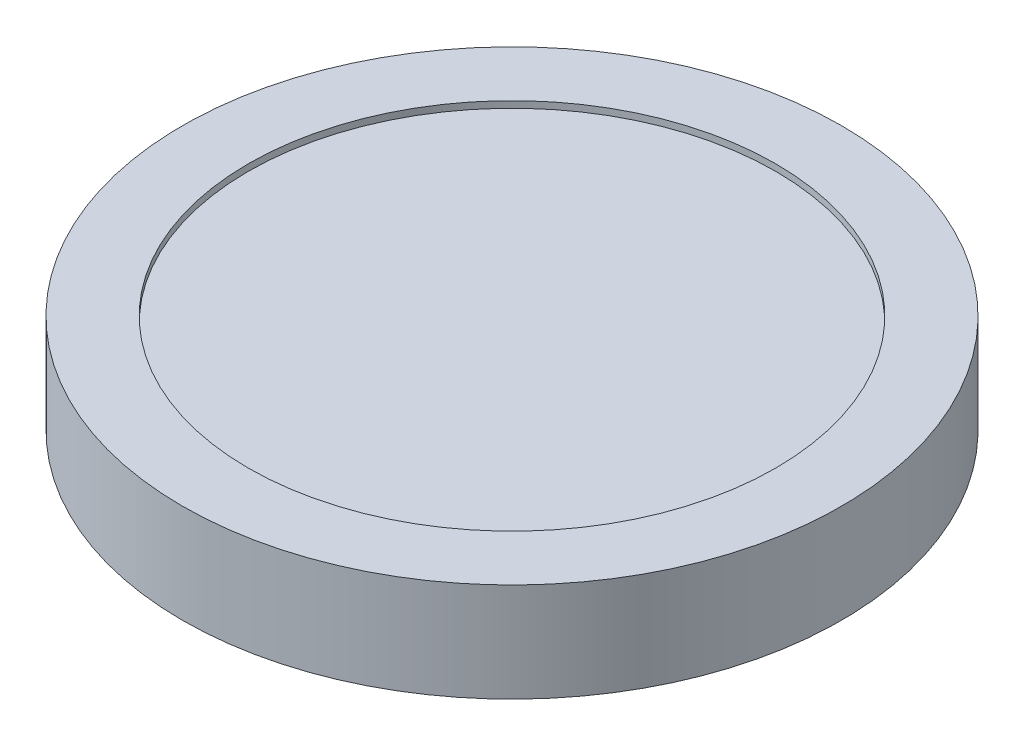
from build123d import *

# Parameters (mm, degrees)
ESQUISSE1_R             = 50
BOSS_EXTRU_1_DEPTH      = 15
ESQUISSE2_R             = 40
ENL_V_MAT_EXTRU_1_DEPTH = 1
ESQUISSE3_R             = 48.5
ENL_V_MAT_EXTRU_2_DEPTH = 13.5


with BuildPart() as part:
    # Esquisse1 → Boss.-Extru.1 (new body)
    with BuildSketch(Plane(origin=(0, 0, 0), x_dir=(1, 0, 0), z_dir=(0, 1, 0))):
        with Locations(Location((0, 0, 0), (0, 0, 270))):
            Circle(ESQUISSE1_R)
    extrude(amount=BOSS_EXTRU_1_DEPTH)

    # Esquisse2 → Enl_v. mat.-Extru.1 (cut)
    with BuildSketch(Plane(origin=(0, 15, 0), x_dir=(1, 0, 0), z_dir=(0, 1, 0))):
        with Locations(Location((0, 0, 0), (0, 0, 270))):
            Circle(ESQUISSE2_R)
    extrude(amount=-ENL_V_MAT_EXTRU_1_DEPTH, mode=Mode.SUBTRACT)

    # Esquisse3 → Enl_v. mat.-Extru.2 (cut)
    with BuildSketch(Plane.XZ):
        with Locations(Location((0, 0, 0), (0, 0, 270))):
            Circle(ESQUISSE3_R)
    extrude(amount=-ENL_V_MAT_EXTRU_2_DEPTH, mode=Mode.SUBTRACT)


solid = part.part
